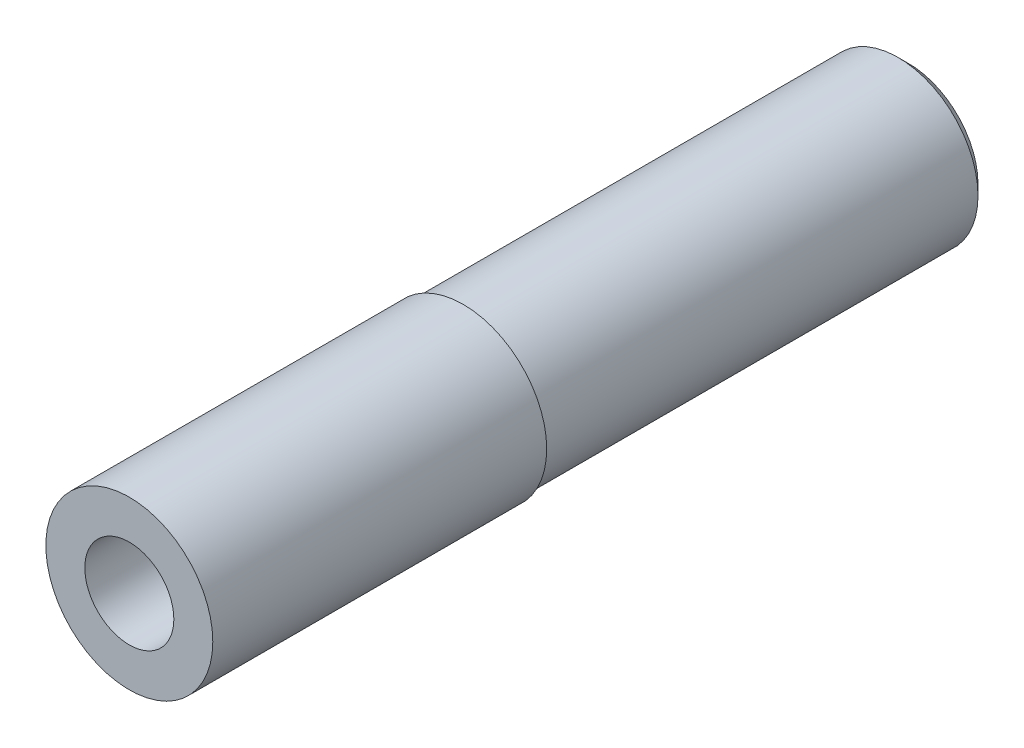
from build123d import *

# Parameters (mm, degrees)
SKETCH5_W          = 8
SKETCH5_H          = 1
CUT_EXTRUDE2_DEPTH = 1.4


with BuildPart() as part:
    # Sketch1 → Revolve1 (revolve)
    with BuildSketch(Plane(origin=(0, 0, 0), x_dir=(0, 0, -1), z_dir=(1, 0, 0)), mode=Mode.PRIVATE) as revolve1_sk:
        Polygon((0, 1.5), (0, 0.8), (2.2, 0.8), (2.2, 0.6), (11, 0.6), (11, 1), (14, 1), (14, 1.25), (13.75, 1.5), align=None)
    revolve(revolve1_sk.sketch.rotate(Axis((0, 0, 3.797909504), (0, 0, -1)), 90), axis=Axis((0, 0, 3.797909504), (0, 0, -1)))

    # Sketch5 → Cut-Revolve1 (revolve, cut)
    with BuildSketch(Plane(origin=(0, 0, 0), x_dir=(0, 0, -1), z_dir=(1, 0, 0)), mode=Mode.PRIVATE) as cut_revolve1_sk:
        with Locations((10, 1.935)):
            Rectangle(SKETCH5_W, SKETCH5_H)
    revolve(cut_revolve1_sk.sketch.rotate(Axis((0, 0, 0), (0, 0, -1)), 90), axis=Axis((0, 0, 0), (0, 0, -1)), mode=Mode.SUBTRACT)

    # Sketch3 → Cut-Extrude2 (cut)
    with BuildSketch(Plane.XY.offset(-2.2)):
        Polygon((0.346410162, 0.6), (-0.346410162, 0.6), (-0.692820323, 0), (-0.346410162, -0.6), (0.346410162, -0.6), (0.692820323, 0), align=None)
    extrude(amount=-CUT_EXTRUDE2_DEPTH, mode=Mode.SUBTRACT)


solid = part.part
